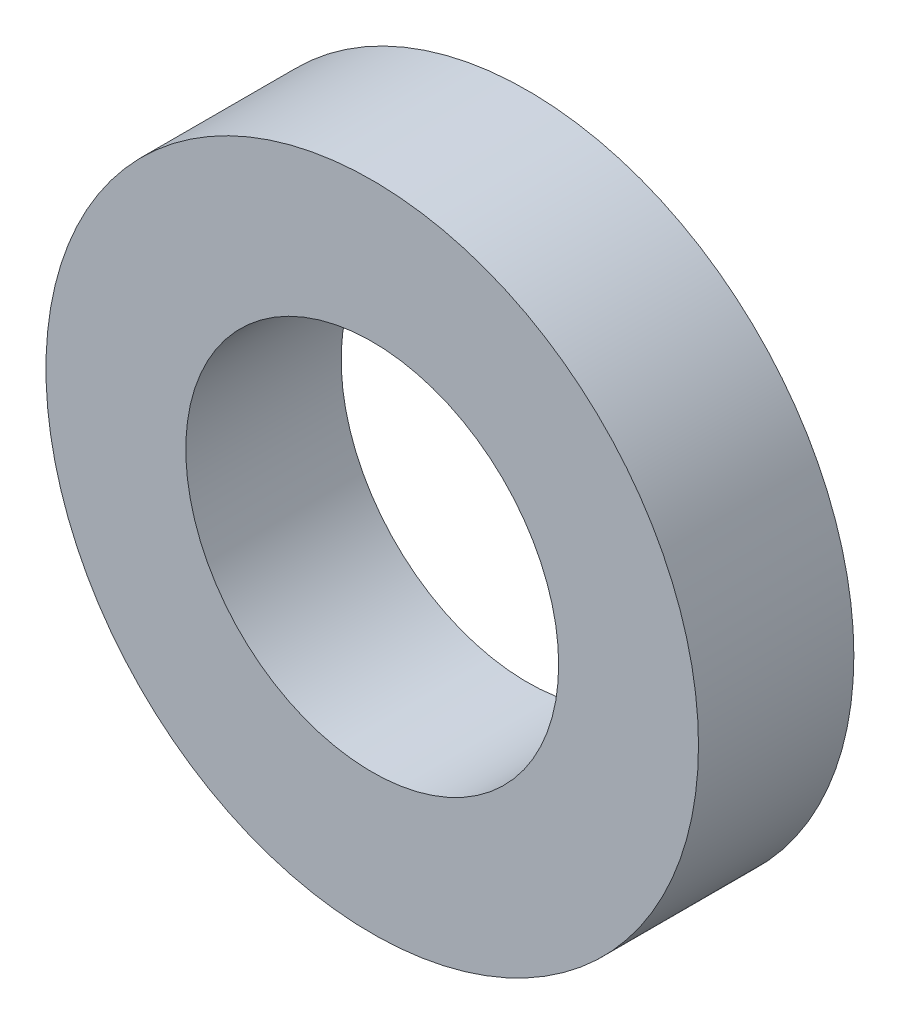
from build123d import *

# Parameters (mm, degrees)
SKETCH_1_R      = 10.5
SKETCH_1_R_2    = 6
EXTRUDE_1_DEPTH = 5


with BuildPart() as part:
    # Sketch 1 → Extrude 1 (new body)
    with BuildSketch(Plane.XY):
        Circle(SKETCH_1_R)
        Circle(SKETCH_1_R_2, mode=Mode.SUBTRACT)
    extrude(amount=EXTRUDE_1_DEPTH)


solid = part.part
